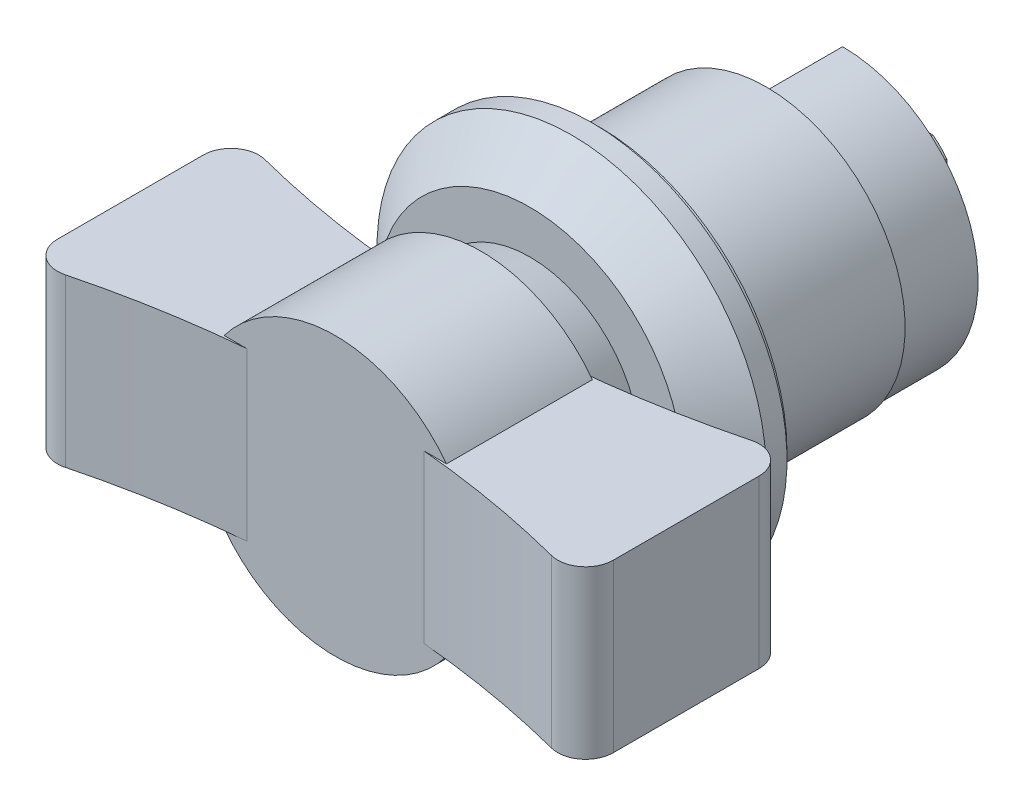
ISO-10303-21;
HEADER;
FILE_DESCRIPTION(('STEP AP214'),'2;1');
FILE_NAME('part.step','',(''),(''),'','','');
FILE_SCHEMA(('AUTOMOTIVE_DESIGN { 1 0 10303 214 1 1 1 1 }'));
ENDSEC;
DATA;
#1=APPLICATION_CONTEXT('core data for automotive mechanical design processes');
#2=APPLICATION_PROTOCOL_DEFINITION('international standard','automotive_design',2000,#1);
#3=PRODUCT_CONTEXT('',#1,'mechanical');
#4=PRODUCT('Part','Part','',(#3));
#5=PRODUCT_RELATED_PRODUCT_CATEGORY('part','',(#4));
#6=PRODUCT_DEFINITION_FORMATION('','',#4);
#7=PRODUCT_DEFINITION_CONTEXT('part definition',#1,'design');
#8=PRODUCT_DEFINITION('design','',#6,#7);
#9=PRODUCT_DEFINITION_SHAPE('','',#8);
#10=(LENGTH_UNIT() NAMED_UNIT(*) SI_UNIT(.MILLI.,.METRE.));
#11=(NAMED_UNIT(*) PLANE_ANGLE_UNIT() SI_UNIT($,.RADIAN.));
#12=(NAMED_UNIT(*) SI_UNIT($,.STERADIAN.) SOLID_ANGLE_UNIT());
#13=UNCERTAINTY_MEASURE_WITH_UNIT(LENGTH_MEASURE(1.E-05),#10,'distance_accuracy_value','');
#14=(GEOMETRIC_REPRESENTATION_CONTEXT(3) GLOBAL_UNCERTAINTY_ASSIGNED_CONTEXT((#13)) GLOBAL_UNIT_ASSIGNED_CONTEXT((#10,
#11,#12)) REPRESENTATION_CONTEXT('',''));
#15=CARTESIAN_POINT('',(0.,0.,0.));
#16=DIRECTION('',(0.,0.,1.));
#17=DIRECTION('',(1.,0.,0.));
#18=AXIS2_PLACEMENT_3D('',#15,#16,#17);
#19=CARTESIAN_POINT('',(0.,0.,5.));
#20=DIRECTION('',(0.,0.,1.));
#21=DIRECTION('',(0.,1.,0.));
#22=AXIS2_PLACEMENT_3D('',#19,#20,#21);
#23=CONICAL_SURFACE('',#22,7.9,0.174532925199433);
#24=CARTESIAN_POINT('',(0.,0.,5.));
#25=DIRECTION('',(0.,0.,1.));
#26=DIRECTION('',(0.,1.,0.));
#27=AXIS2_PLACEMENT_3D('',#24,#25,#26);
#28=CIRCLE('',#27,7.9);
#29=CARTESIAN_POINT('',(0.,7.9,5.));
#30=VERTEX_POINT('',#29);
#31=EDGE_CURVE('E221',#30,#30,#28,.T.);
#32=ORIENTED_EDGE('',*,*,#31,.T.);
#33=EDGE_LOOP('',(#32));
#34=FACE_BOUND('',#33,.T.);
#35=CARTESIAN_POINT('',(-6.3650101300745,5.65936835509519,8.5000182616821));
#36=CARTESIAN_POINT('',(-6.52348846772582,5.47732706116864,8.48554618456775));
#37=CARTESIAN_POINT('',(-6.67421622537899,5.28853534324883,8.47124040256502));
#38=CARTESIAN_POINT('',(-6.95922194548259,4.89888542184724,8.443354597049));
#39=CARTESIAN_POINT('',(-7.09350093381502,4.69802797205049,8.429774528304));
#40=CARTESIAN_POINT('',(-7.34459853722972,4.28579242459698,8.40373991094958));
#41=CARTESIAN_POINT('',(-7.46142848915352,4.07442127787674,8.3912846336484));
#42=CARTESIAN_POINT('',(-7.67694162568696,3.64254603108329,8.3678436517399));
#43=CARTESIAN_POINT('',(-7.77562494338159,3.42204199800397,8.35685793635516));
#44=CARTESIAN_POINT('',(-7.95420744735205,2.97336423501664,8.33666539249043));
#45=CARTESIAN_POINT('',(-8.03409846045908,2.74518721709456,8.32745933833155));
#46=CARTESIAN_POINT('',(-8.17449310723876,2.28286798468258,8.3110950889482));
#47=CARTESIAN_POINT('',(-8.23499634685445,2.04872564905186,8.30393693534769));
#48=CARTESIAN_POINT('',(-8.33617934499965,1.57621212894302,8.29187560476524));
#49=CARTESIAN_POINT('',(-8.37686501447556,1.33784222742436,8.28697175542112));
#50=CARTESIAN_POINT('',(-8.43815706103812,0.858499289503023,8.27955648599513));
#51=CARTESIAN_POINT('',(-8.45876356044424,0.617526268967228,8.27704505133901));
#52=CARTESIAN_POINT('',(-8.47975753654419,0.134609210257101,8.27448621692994));
#53=CARTESIAN_POINT('',(-8.48013842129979,-0.107335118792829,8.27443962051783));
#54=CARTESIAN_POINT('',(-8.46066189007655,-0.590395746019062,8.2768138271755));
#55=CARTESIAN_POINT('',(-8.44080445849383,-0.831512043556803,8.27923463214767));
#56=CARTESIAN_POINT('',(-8.38097280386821,-1.31133764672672,8.28647617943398));
#57=CARTESIAN_POINT('',(-8.34098721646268,-1.55004551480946,8.29129827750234));
#58=CARTESIAN_POINT('',(-8.24117327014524,-2.02321009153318,8.30320439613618));
#59=CARTESIAN_POINT('',(-8.18134557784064,-2.25766694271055,8.31028834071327));
#60=CARTESIAN_POINT('',(-8.04223492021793,-2.720762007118,8.32651816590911));
#61=CARTESIAN_POINT('',(-7.96294438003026,-2.94939791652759,8.33566484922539));
#62=CARTESIAN_POINT('',(-7.78546779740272,-3.39912743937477,8.35575637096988));
#63=CARTESIAN_POINT('',(-7.68728230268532,-3.62022127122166,8.36670115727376));
#64=CARTESIAN_POINT('',(-7.47285910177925,-4.05296235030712,8.39005736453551));
#65=CARTESIAN_POINT('',(-7.35664923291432,-4.26462352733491,8.40246651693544));
#66=CARTESIAN_POINT('',(-7.10690397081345,-4.67727413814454,8.42840647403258));
#67=CARTESIAN_POINT('',(-6.97337788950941,-4.8782692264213,8.4419366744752));
#68=CARTESIAN_POINT('',(-6.75815188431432,-5.17434161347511,8.46304239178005));
#69=CARTESIAN_POINT('',(-6.68243675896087,-5.27383960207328,8.47034986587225));
#70=CARTESIAN_POINT('',(-6.52683785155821,-5.46927356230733,8.48509655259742));
#71=CARTESIAN_POINT('',(-6.44696028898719,-5.56521450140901,8.49253555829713));
#72=CARTESIAN_POINT('',(-6.3650101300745,-5.65936835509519,8.50001826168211));
#73=B_SPLINE_CURVE_WITH_KNOTS('',3,(#35,#36,#37,#38,#39,#40,#41,#42,#43,#44,#45,#46,#47,#48,#49,
#50,#51,#52,#53,#54,#55,#56,#57,#58,#59,#60,#61,#62,#63,#64,#65,#66,#67,#68,#69,#70,#71,#72),
.UNSPECIFIED.,.F.,.F.,(4,2,2,2,2,2,2,2,2,2,2,2,2,2,2,2,2,2,4),(0.,0.725152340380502,
1.45025943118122,2.17489334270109,2.89952193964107,3.62446511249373,4.349423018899,
5.07416456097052,5.79890168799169,6.52387502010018,7.24884891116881,7.97423258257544,
8.6995918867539,9.42523394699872,10.1508549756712,10.8753662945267,11.5994896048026,
11.9751164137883,12.3501972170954),.UNSPECIFIED.);
#74=CARTESIAN_POINT('',(-6.36521013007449,5.65913856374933,8.5));
#75=VERTEX_POINT('',#74);
#76=CARTESIAN_POINT('',(-6.36521013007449,-5.65913856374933,8.5));
#77=VERTEX_POINT('',#76);
#78=EDGE_CURVE('E288',#75,#77,#73,.T.);
#79=ORIENTED_EDGE('',*,*,#78,.F.);
#80=CARTESIAN_POINT('',(0.,0.,8.5));
#81=DIRECTION('',(0.,0.,1.));
#82=DIRECTION('',(0.,1.,0.));
#83=AXIS2_PLACEMENT_3D('',#80,#81,#82);
#84=CIRCLE('',#83,8.51714443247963);
#85=CARTESIAN_POINT('',(6.36521013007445,5.65913856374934,8.5));
#86=VERTEX_POINT('',#85);
#87=EDGE_CURVE('E358',#86,#75,#84,.T.);
#88=ORIENTED_EDGE('',*,*,#87,.F.);
#89=CARTESIAN_POINT('',(6.36501013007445,-5.65936835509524,8.5000182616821));
#90=CARTESIAN_POINT('',(6.52348846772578,-5.4773270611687,8.48554618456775));
#91=CARTESIAN_POINT('',(6.67421622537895,-5.28853534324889,8.47124040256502));
#92=CARTESIAN_POINT('',(6.95922194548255,-4.89888542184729,8.443354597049));
#93=CARTESIAN_POINT('',(7.09350093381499,-4.69802797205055,8.42977452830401));
#94=CARTESIAN_POINT('',(7.34459853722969,-4.28579242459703,8.40373991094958));
#95=CARTESIAN_POINT('',(7.46142848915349,-4.07442127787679,8.3912846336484));
#96=CARTESIAN_POINT('',(7.67694162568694,-3.64254603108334,8.3678436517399));
#97=CARTESIAN_POINT('',(7.77562494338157,-3.42204199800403,8.35685793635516));
#98=CARTESIAN_POINT('',(7.95420744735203,-2.9733642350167,8.33666539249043));
#99=CARTESIAN_POINT('',(8.03409846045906,-2.74518721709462,8.32745933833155));
#100=CARTESIAN_POINT('',(8.17449310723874,-2.28286798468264,8.3110950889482));
#101=CARTESIAN_POINT('',(8.23499634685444,-2.04872564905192,8.30393693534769));
#102=CARTESIAN_POINT('',(8.33617934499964,-1.57621212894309,8.29187560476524));
#103=CARTESIAN_POINT('',(8.37686501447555,-1.33784222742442,8.28697175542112));
#104=CARTESIAN_POINT('',(8.43815706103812,-0.858499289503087,8.27955648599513));
#105=CARTESIAN_POINT('',(8.45876356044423,-0.617526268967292,8.27704505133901));
#106=CARTESIAN_POINT('',(8.47975753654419,-0.134609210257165,8.27448621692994));
#107=CARTESIAN_POINT('',(8.48013842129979,0.107335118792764,8.27443962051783));
#108=CARTESIAN_POINT('',(8.46066189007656,0.590395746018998,8.2768138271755));
#109=CARTESIAN_POINT('',(8.44080445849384,0.831512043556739,8.27923463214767));
#110=CARTESIAN_POINT('',(8.38097280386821,1.31133764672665,8.28647617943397));
#111=CARTESIAN_POINT('',(8.34098721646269,1.55004551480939,8.29129827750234));
#112=CARTESIAN_POINT('',(8.24117327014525,2.02321009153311,8.30320439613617));
#113=CARTESIAN_POINT('',(8.18134557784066,2.25766694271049,8.31028834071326));
#114=CARTESIAN_POINT('',(8.04223492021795,2.72076200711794,8.32651816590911));
#115=CARTESIAN_POINT('',(7.96294438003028,2.94939791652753,8.33566484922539));
#116=CARTESIAN_POINT('',(7.78546779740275,3.39912743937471,8.35575637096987));
#117=CARTESIAN_POINT('',(7.68728230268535,3.62022127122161,8.36670115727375));
#118=CARTESIAN_POINT('',(7.47285910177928,4.05296235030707,8.39005736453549));
#119=CARTESIAN_POINT('',(7.35664923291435,4.26462352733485,8.40246651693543));
#120=CARTESIAN_POINT('',(7.10690397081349,4.67727413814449,8.42840647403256));
#121=CARTESIAN_POINT('',(6.97337788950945,4.87826922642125,8.44193667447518));
#122=CARTESIAN_POINT('',(6.75815188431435,5.17434161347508,8.46304239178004));
#123=CARTESIAN_POINT('',(6.68243675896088,5.27383960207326,8.47034986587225));
#124=CARTESIAN_POINT('',(6.5268378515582,5.46927356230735,8.48509655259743));
#125=CARTESIAN_POINT('',(6.44696028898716,5.56521450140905,8.49253555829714));
#126=CARTESIAN_POINT('',(6.36501013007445,5.65936835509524,8.50001826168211));
#127=B_SPLINE_CURVE_WITH_KNOTS('',3,(#89,#90,#91,#92,#93,#94,#95,#96,#97,#98,#99,#100,#101,#102,
#103,#104,#105,#106,#107,#108,#109,#110,#111,#112,#113,#114,#115,#116,#117,#118,#119,#120,#121,
#122,#123,#124,#125,#126),.UNSPECIFIED.,.F.,.F.,(4,2,2,2,2,2,2,2,2,2,2,2,2,2,2,2,2,2,4),(0.,
0.725152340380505,1.45025943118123,2.1748933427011,2.89952193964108,3.62446511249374,
4.34942301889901,5.07416456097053,5.7989016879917,6.52387502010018,7.24884891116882,
7.97423258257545,8.69959188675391,9.42523394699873,10.1508549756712,10.8753662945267,
11.5994896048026,11.9751164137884,12.3501972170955),.UNSPECIFIED.);
#128=CARTESIAN_POINT('',(6.36521013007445,-5.65913856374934,8.5));
#129=VERTEX_POINT('',#128);
#130=EDGE_CURVE('E279',#129,#86,#127,.T.);
#131=ORIENTED_EDGE('',*,*,#130,.F.);
#132=EDGE_CURVE('E359',#77,#129,#84,.T.);
#133=ORIENTED_EDGE('',*,*,#132,.F.);
#134=EDGE_LOOP('',(#79,#88,#131,#133));
#135=FACE_BOUND('',#134,.T.);
#136=ADVANCED_FACE('F14',(#34,#135),#23,.T.);
#137=CARTESIAN_POINT('',(0.,0.,8.5));
#138=DIRECTION('',(0.,0.,1.));
#139=DIRECTION('',(0.,1.,0.));
#140=AXIS2_PLACEMENT_3D('',#137,#138,#139);
#141=PLANE('',#140);
#142=DIRECTION('',(1.,0.,0.));
#143=VECTOR('',#142,1.);
#144=CARTESIAN_POINT('',(0.,6.,8.5));
#145=LINE('',#144,#143);
#146=CARTESIAN_POINT('',(-8.,6.,8.5));
#147=VERTEX_POINT('',#146);
#148=CARTESIAN_POINT('',(-6.36521013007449,6.,8.5));
#149=VERTEX_POINT('',#148);
#150=EDGE_CURVE('E267',#147,#149,#145,.T.);
#151=ORIENTED_EDGE('',*,*,#150,.F.);
#152=CARTESIAN_POINT('',(0.,0.,8.5));
#153=DIRECTION('',(0.,0.,1.));
#154=DIRECTION('',(0.,1.,0.));
#155=AXIS2_PLACEMENT_3D('',#152,#153,#154);
#156=CIRCLE('',#155,10.);
#157=CARTESIAN_POINT('',(8.,6.,8.5));
#158=VERTEX_POINT('',#157);
#159=EDGE_CURVE('E360',#158,#147,#156,.T.);
#160=ORIENTED_EDGE('',*,*,#159,.F.);
#161=CARTESIAN_POINT('',(6.36521013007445,6.,8.5));
#162=VERTEX_POINT('',#161);
#163=EDGE_CURVE('E264',#162,#158,#145,.T.);
#164=ORIENTED_EDGE('',*,*,#163,.F.);
#165=DIRECTION('',(0.,1.,0.));
#166=VECTOR('',#165,1.);
#167=CARTESIAN_POINT('',(6.36521013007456,-6.,8.5));
#168=LINE('',#167,#166);
#169=EDGE_CURVE('E22',#86,#162,#168,.T.);
#170=ORIENTED_EDGE('',*,*,#169,.F.);
#171=ORIENTED_EDGE('',*,*,#87,.T.);
#172=DIRECTION('',(0.,1.,0.));
#173=VECTOR('',#172,1.);
#174=CARTESIAN_POINT('',(-6.36521013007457,-6.,8.5));
#175=LINE('',#174,#173);
#176=EDGE_CURVE('E9',#149,#75,#175,.F.);
#177=ORIENTED_EDGE('',*,*,#176,.F.);
#178=EDGE_LOOP('',(#151,#160,#164,#170,#171,#177));
#179=FACE_BOUND('',#178,.T.);
#180=ADVANCED_FACE('F327',(#179),#141,.F.);
#181=CARTESIAN_POINT('',(0.,0.,19.));
#182=DIRECTION('',(0.,0.,-1.));
#183=DIRECTION('',(0.,-1.,0.));
#184=AXIS2_PLACEMENT_3D('',#181,#182,#183);
#185=CYLINDRICAL_SURFACE('',#184,10.);
#186=DIRECTION('',(0.,0.,-1.));
#187=VECTOR('',#186,1.);
#188=CARTESIAN_POINT('',(-8.,6.,19.));
#189=LINE('',#188,#187);
#190=CARTESIAN_POINT('',(-8.,6.,19.));
#191=VERTEX_POINT('',#190);
#192=EDGE_CURVE('E266',#191,#147,#189,.T.);
#193=ORIENTED_EDGE('',*,*,#192,.F.);
#194=CARTESIAN_POINT('',(0.,0.,19.));
#195=DIRECTION('',(0.,0.,1.));
#196=DIRECTION('',(0.,1.,0.));
#197=AXIS2_PLACEMENT_3D('',#194,#195,#196);
#198=CIRCLE('',#197,10.);
#199=CARTESIAN_POINT('',(8.,6.,19.));
#200=VERTEX_POINT('',#199);
#201=EDGE_CURVE('E495',#200,#191,#198,.T.);
#202=ORIENTED_EDGE('',*,*,#201,.F.);
#203=DIRECTION('',(0.,0.,-1.));
#204=VECTOR('',#203,1.);
#205=CARTESIAN_POINT('',(8.,6.,19.));
#206=LINE('',#205,#204);
#207=EDGE_CURVE('E37',#158,#200,#206,.F.);
#208=ORIENTED_EDGE('',*,*,#207,.F.);
#209=ORIENTED_EDGE('',*,*,#159,.T.);
#210=EDGE_LOOP('',(#193,#202,#208,#209));
#211=FACE_BOUND('',#210,.T.);
#212=ADVANCED_FACE('F332',(#211),#185,.T.);
#213=CARTESIAN_POINT('',(0.,0.,-50.));
#214=DIRECTION('',(0.,0.,-1.));
#215=DIRECTION('',(0.,-1.,0.));
#216=AXIS2_PLACEMENT_3D('',#213,#214,#215);
#217=CYLINDRICAL_SURFACE('',#216,5.);
#218=CARTESIAN_POINT('',(0.,0.,-17.5));
#219=DIRECTION('',(0.,0.,-1.));
#220=DIRECTION('',(0.,-1.,0.));
#221=AXIS2_PLACEMENT_3D('',#218,#219,#220);
#222=CIRCLE('',#221,5.);
#223=CARTESIAN_POINT('',(-3.,-4.,-17.5));
#224=VERTEX_POINT('',#223);
#225=CARTESIAN_POINT('',(-4.,-3.,-17.5));
#226=VERTEX_POINT('',#225);
#227=EDGE_CURVE('E464',#224,#226,#222,.T.);
#228=ORIENTED_EDGE('',*,*,#227,.T.);
#229=DIRECTION('',(0.,0.,-1.));
#230=VECTOR('',#229,1.);
#231=CARTESIAN_POINT('',(-4.,-3.,-11.4172374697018));
#232=LINE('',#231,#230);
#233=CARTESIAN_POINT('',(-4.,-3.,-21.));
#234=VERTEX_POINT('',#233);
#235=EDGE_CURVE('E406',#226,#234,#232,.T.);
#236=ORIENTED_EDGE('',*,*,#235,.T.);
#237=CARTESIAN_POINT('',(0.,0.,-21.));
#238=DIRECTION('',(0.,0.,-1.));
#239=DIRECTION('',(0.,-1.,0.));
#240=AXIS2_PLACEMENT_3D('',#237,#238,#239);
#241=CIRCLE('',#240,5.);
#242=CARTESIAN_POINT('',(-3.,-4.,-21.));
#243=VERTEX_POINT('',#242);
#244=EDGE_CURVE('E466',#243,#234,#241,.T.);
#245=ORIENTED_EDGE('',*,*,#244,.F.);
#246=DIRECTION('',(0.,0.,-1.));
#247=VECTOR('',#246,1.);
#248=CARTESIAN_POINT('',(-3.,-4.,-11.4172374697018));
#249=LINE('',#248,#247);
#250=EDGE_CURVE('E430',#224,#243,#249,.T.);
#251=ORIENTED_EDGE('',*,*,#250,.F.);
#252=EDGE_LOOP('',(#228,#236,#245,#251));
#253=FACE_BOUND('',#252,.T.);
#254=ADVANCED_FACE('F339',(#253),#217,.T.);
#255=DIRECTION('',(0.,0.,-1.));
#256=VECTOR('',#255,1.);
#257=CARTESIAN_POINT('',(4.,-3.,-11.4172374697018));
#258=LINE('',#257,#256);
#259=CARTESIAN_POINT('',(4.,-3.,-17.5));
#260=VERTEX_POINT('',#259);
#261=CARTESIAN_POINT('',(4.,-3.,-21.));
#262=VERTEX_POINT('',#261);
#263=EDGE_CURVE('E411',#260,#262,#258,.T.);
#264=ORIENTED_EDGE('',*,*,#263,.F.);
#265=CARTESIAN_POINT('',(3.,-4.,-17.5));
#266=VERTEX_POINT('',#265);
#267=EDGE_CURVE('E471',#260,#266,#222,.T.);
#268=ORIENTED_EDGE('',*,*,#267,.T.);
#269=DIRECTION('',(0.,0.,-1.));
#270=VECTOR('',#269,1.);
#271=CARTESIAN_POINT('',(3.,-4.,-11.4172374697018));
#272=LINE('',#271,#270);
#273=CARTESIAN_POINT('',(3.,-4.,-21.));
#274=VERTEX_POINT('',#273);
#275=EDGE_CURVE('E427',#266,#274,#272,.T.);
#276=ORIENTED_EDGE('',*,*,#275,.T.);
#277=EDGE_CURVE('E465',#262,#274,#241,.T.);
#278=ORIENTED_EDGE('',*,*,#277,.F.);
#279=EDGE_LOOP('',(#264,#268,#276,#278));
#280=FACE_BOUND('',#279,.T.);
#281=ADVANCED_FACE('F681',(#280),#217,.T.);
#282=DIRECTION('',(0.,0.,-1.));
#283=VECTOR('',#282,1.);
#284=CARTESIAN_POINT('',(4.,3.,-11.4172374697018));
#285=LINE('',#284,#283);
#286=CARTESIAN_POINT('',(4.,3.,-17.5));
#287=VERTEX_POINT('',#286);
#288=CARTESIAN_POINT('',(4.,3.,-21.));
#289=VERTEX_POINT('',#288);
#290=EDGE_CURVE('E416',#287,#289,#285,.T.);
#291=ORIENTED_EDGE('',*,*,#290,.T.);
#292=CARTESIAN_POINT('',(3.,4.,-21.));
#293=VERTEX_POINT('',#292);
#294=EDGE_CURVE('E461',#293,#289,#241,.T.);
#295=ORIENTED_EDGE('',*,*,#294,.F.);
#296=DIRECTION('',(0.,0.,-1.));
#297=VECTOR('',#296,1.);
#298=CARTESIAN_POINT('',(3.,4.,-11.4172374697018));
#299=LINE('',#298,#297);
#300=CARTESIAN_POINT('',(3.,4.,-17.5));
#301=VERTEX_POINT('',#300);
#302=EDGE_CURVE('E432',#301,#293,#299,.T.);
#303=ORIENTED_EDGE('',*,*,#302,.F.);
#304=EDGE_CURVE('E467',#301,#287,#222,.T.);
#305=ORIENTED_EDGE('',*,*,#304,.T.);
#306=EDGE_LOOP('',(#291,#295,#303,#305));
#307=FACE_BOUND('',#306,.T.);
#308=ADVANCED_FACE('F690',(#307),#217,.T.);
#309=CARTESIAN_POINT('',(-5.,0.,-21.));
#310=DIRECTION('',(0.,0.,1.));
#311=DIRECTION('',(0.,1.,0.));
#312=AXIS2_PLACEMENT_3D('',#309,#310,#311);
#313=PLANE('',#312);
#314=CARTESIAN_POINT('',(0.,0.,-21.));
#315=DIRECTION('',(0.,0.,-1.));
#316=DIRECTION('',(0.,-1.,0.));
#317=AXIS2_PLACEMENT_3D('',#314,#315,#316);
#318=CIRCLE('',#317,3.);
#319=CARTESIAN_POINT('',(0.,-3.,-21.));
#320=VERTEX_POINT('',#319);
#321=EDGE_CURVE('E365',#320,#320,#318,.T.);
#322=ORIENTED_EDGE('',*,*,#321,.F.);
#323=EDGE_LOOP('',(#322));
#324=FACE_BOUND('',#323,.T.);
#325=ORIENTED_EDGE('',*,*,#244,.T.);
#326=DIRECTION('',(0.,-1.,0.));
#327=VECTOR('',#326,1.);
#328=CARTESIAN_POINT('',(-4.,3.,-21.));
#329=LINE('',#328,#327);
#330=CARTESIAN_POINT('',(-4.,3.,-21.));
#331=VERTEX_POINT('',#330);
#332=EDGE_CURVE('E402',#331,#234,#329,.T.);
#333=ORIENTED_EDGE('',*,*,#332,.F.);
#334=CARTESIAN_POINT('',(-3.,4.,-21.));
#335=VERTEX_POINT('',#334);
#336=EDGE_CURVE('E460',#331,#335,#241,.T.);
#337=ORIENTED_EDGE('',*,*,#336,.T.);
#338=DIRECTION('',(1.,0.,0.));
#339=VECTOR('',#338,1.);
#340=CARTESIAN_POINT('',(-3.,4.,-21.));
#341=LINE('',#340,#339);
#342=EDGE_CURVE('E433',#335,#293,#341,.T.);
#343=ORIENTED_EDGE('',*,*,#342,.T.);
#344=ORIENTED_EDGE('',*,*,#294,.T.);
#345=DIRECTION('',(0.,-1.,0.));
#346=VECTOR('',#345,1.);
#347=CARTESIAN_POINT('',(4.,3.,-21.));
#348=LINE('',#347,#346);
#349=EDGE_CURVE('E412',#289,#262,#348,.T.);
#350=ORIENTED_EDGE('',*,*,#349,.T.);
#351=ORIENTED_EDGE('',*,*,#277,.T.);
#352=DIRECTION('',(1.,0.,0.));
#353=VECTOR('',#352,1.);
#354=CARTESIAN_POINT('',(-3.,-4.,-21.));
#355=LINE('',#354,#353);
#356=EDGE_CURVE('E418',#243,#274,#355,.T.);
#357=ORIENTED_EDGE('',*,*,#356,.F.);
#358=EDGE_LOOP('',(#325,#333,#337,#343,#344,#350,#351,#357));
#359=FACE_BOUND('',#358,.T.);
#360=ADVANCED_FACE('F698',(#324,#359),#313,.F.);
#361=ORIENTED_EDGE('',*,*,#336,.F.);
#362=DIRECTION('',(0.,0.,-1.));
#363=VECTOR('',#362,1.);
#364=CARTESIAN_POINT('',(-4.,3.,-11.4172374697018));
#365=LINE('',#364,#363);
#366=CARTESIAN_POINT('',(-4.,3.,-17.5));
#367=VERTEX_POINT('',#366);
#368=EDGE_CURVE('E409',#367,#331,#365,.T.);
#369=ORIENTED_EDGE('',*,*,#368,.F.);
#370=CARTESIAN_POINT('',(0.,0.,-17.5));
#371=DIRECTION('',(0.,0.,-1.));
#372=DIRECTION('',(0.,-1.,0.));
#373=AXIS2_PLACEMENT_3D('',#370,#371,#372);
#374=CIRCLE('',#373,5.);
#375=CARTESIAN_POINT('',(-5.,0.,-17.5));
#376=VERTEX_POINT('',#375);
#377=EDGE_CURVE('E382',#376,#367,#374,.T.);
#378=ORIENTED_EDGE('',*,*,#377,.F.);
#379=DIRECTION('',(0.,0.,-1.));
#380=VECTOR('',#379,1.);
#381=CARTESIAN_POINT('',(-5.,0.,1.78858223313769));
#382=LINE('',#381,#380);
#383=CARTESIAN_POINT('',(-5.,0.,-12.));
#384=VERTEX_POINT('',#383);
#385=EDGE_CURVE('E397',#384,#376,#382,.T.);
#386=ORIENTED_EDGE('',*,*,#385,.F.);
#387=CARTESIAN_POINT('',(0.,0.,-12.));
#388=DIRECTION('',(0.,0.,1.));
#389=DIRECTION('',(0.,1.,0.));
#390=AXIS2_PLACEMENT_3D('',#387,#388,#389);
#391=CIRCLE('',#390,5.);
#392=CARTESIAN_POINT('',(0.,5.,-12.));
#393=VERTEX_POINT('',#392);
#394=EDGE_CURVE('E389',#384,#393,#391,.F.);
#395=ORIENTED_EDGE('',*,*,#394,.T.);
#396=DIRECTION('',(0.,0.,-1.));
#397=VECTOR('',#396,1.);
#398=CARTESIAN_POINT('',(0.,5.,1.78858223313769));
#399=LINE('',#398,#397);
#400=CARTESIAN_POINT('',(0.,5.,-17.5));
#401=VERTEX_POINT('',#400);
#402=EDGE_CURVE('E392',#393,#401,#399,.T.);
#403=ORIENTED_EDGE('',*,*,#402,.T.);
#404=CARTESIAN_POINT('',(-3.,4.,-17.5));
#405=VERTEX_POINT('',#404);
#406=EDGE_CURVE('E384',#405,#401,#374,.T.);
#407=ORIENTED_EDGE('',*,*,#406,.F.);
#408=DIRECTION('',(0.,0.,-1.));
#409=VECTOR('',#408,1.);
#410=CARTESIAN_POINT('',(-3.,4.,-11.4172374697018));
#411=LINE('',#410,#409);
#412=EDGE_CURVE('E437',#405,#335,#411,.T.);
#413=ORIENTED_EDGE('',*,*,#412,.T.);
#414=EDGE_LOOP('',(#361,#369,#378,#386,#395,#403,#407,#413));
#415=FACE_BOUND('',#414,.T.);
#416=ADVANCED_FACE('F684',(#415),#217,.T.);
#417=CARTESIAN_POINT('',(0.,0.,-50.));
#418=DIRECTION('',(0.,0.,-1.));
#419=DIRECTION('',(0.,-1.,0.));
#420=AXIS2_PLACEMENT_3D('',#417,#418,#419);
#421=CYLINDRICAL_SURFACE('',#420,10.);
#422=CARTESIAN_POINT('',(0.,0.,-12.));
#423=DIRECTION('',(0.,0.,-1.));
#424=DIRECTION('',(0.,-1.,0.));
#425=AXIS2_PLACEMENT_3D('',#422,#423,#424);
#426=CIRCLE('',#425,10.);
#427=CARTESIAN_POINT('',(0.,-10.,-12.));
#428=VERTEX_POINT('',#427);
#429=EDGE_CURVE('E477',#428,#428,#426,.T.);
#430=ORIENTED_EDGE('',*,*,#429,.F.);
#431=EDGE_LOOP('',(#430));
#432=FACE_BOUND('',#431,.T.);
#433=CARTESIAN_POINT('',(0.,0.,0.));
#434=DIRECTION('',(0.,0.,-1.));
#435=DIRECTION('',(0.,-1.,0.));
#436=AXIS2_PLACEMENT_3D('',#433,#434,#435);
#437=CIRCLE('',#436,10.);
#438=CARTESIAN_POINT('',(0.,-10.,0.));
#439=VERTEX_POINT('',#438);
#440=EDGE_CURVE('E439',#439,#439,#437,.T.);
#441=ORIENTED_EDGE('',*,*,#440,.T.);
#442=EDGE_LOOP('',(#441));
#443=FACE_BOUND('',#442,.T.);
#444=ADVANCED_FACE('F16',(#432,#443),#421,.T.);
#445=CARTESIAN_POINT('',(-10.,0.,-12.));
#446=DIRECTION('',(0.,0.,1.));
#447=DIRECTION('',(0.,1.,0.));
#448=AXIS2_PLACEMENT_3D('',#445,#446,#447);
#449=PLANE('',#448);
#450=CARTESIAN_POINT('',(0.,0.,-12.));
#451=DIRECTION('',(0.,0.,-1.));
#452=DIRECTION('',(0.,-1.,0.));
#453=AXIS2_PLACEMENT_3D('',#450,#451,#452);
#454=CIRCLE('',#453,9.75);
#455=CARTESIAN_POINT('',(0.,9.75,-12.));
#456=VERTEX_POINT('',#455);
#457=CARTESIAN_POINT('',(-9.75,0.,-12.));
#458=VERTEX_POINT('',#457);
#459=EDGE_CURVE('E474',#456,#458,#454,.T.);
#460=ORIENTED_EDGE('',*,*,#459,.F.);
#461=DIRECTION('',(0.,-1.,0.));
#462=VECTOR('',#461,1.);
#463=CARTESIAN_POINT('',(0.,9.75,-12.));
#464=LINE('',#463,#462);
#465=EDGE_CURVE('E388',#456,#393,#464,.T.);
#466=ORIENTED_EDGE('',*,*,#465,.T.);
#467=ORIENTED_EDGE('',*,*,#394,.F.);
#468=DIRECTION('',(1.,0.,0.));
#469=VECTOR('',#468,1.);
#470=CARTESIAN_POINT('',(-9.75,0.,-12.));
#471=LINE('',#470,#469);
#472=EDGE_CURVE('E376',#458,#384,#471,.T.);
#473=ORIENTED_EDGE('',*,*,#472,.F.);
#474=EDGE_LOOP('',(#460,#466,#467,#473));
#475=FACE_BOUND('',#474,.T.);
#476=ORIENTED_EDGE('',*,*,#429,.T.);
#477=EDGE_LOOP('',(#476));
#478=FACE_BOUND('',#477,.T.);
#479=ADVANCED_FACE('F721',(#475,#478),#449,.F.);
#480=CARTESIAN_POINT('',(0.,0.,-50.));
#481=DIRECTION('',(0.,0.,-1.));
#482=DIRECTION('',(0.,-1.,0.));
#483=AXIS2_PLACEMENT_3D('',#480,#481,#482);
#484=CYLINDRICAL_SURFACE('',#483,9.75);
#485=CARTESIAN_POINT('',(0.,0.,-17.5));
#486=DIRECTION('',(0.,0.,-1.));
#487=DIRECTION('',(0.,-1.,0.));
#488=AXIS2_PLACEMENT_3D('',#485,#486,#487);
#489=CIRCLE('',#488,9.75);
#490=CARTESIAN_POINT('',(0.,9.75,-17.5));
#491=VERTEX_POINT('',#490);
#492=CARTESIAN_POINT('',(-9.75,0.,-17.5));
#493=VERTEX_POINT('',#492);
#494=EDGE_CURVE('E470',#491,#493,#489,.T.);
#495=ORIENTED_EDGE('',*,*,#494,.F.);
#496=DIRECTION('',(0.,0.,-1.));
#497=VECTOR('',#496,1.);
#498=CARTESIAN_POINT('',(0.,9.75,1.78858223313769));
#499=LINE('',#498,#497);
#500=EDGE_CURVE('E380',#456,#491,#499,.T.);
#501=ORIENTED_EDGE('',*,*,#500,.F.);
#502=ORIENTED_EDGE('',*,*,#459,.T.);
#503=DIRECTION('',(0.,0.,-1.));
#504=VECTOR('',#503,1.);
#505=CARTESIAN_POINT('',(-9.75,0.,1.78858223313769));
#506=LINE('',#505,#504);
#507=EDGE_CURVE('E381',#458,#493,#506,.T.);
#508=ORIENTED_EDGE('',*,*,#507,.T.);
#509=EDGE_LOOP('',(#495,#501,#502,#508));
#510=FACE_BOUND('',#509,.T.);
#511=ADVANCED_FACE('F729',(#510),#484,.T.);
#512=CARTESIAN_POINT('',(-9.75,0.,-17.5));
#513=DIRECTION('',(0.,0.,1.));
#514=DIRECTION('',(0.,1.,0.));
#515=AXIS2_PLACEMENT_3D('',#512,#513,#514);
#516=PLANE('',#515);
#517=ORIENTED_EDGE('',*,*,#406,.T.);
#518=DIRECTION('',(0.,-1.,0.));
#519=VECTOR('',#518,1.);
#520=CARTESIAN_POINT('',(0.,9.75,-17.5));
#521=LINE('',#520,#519);
#522=EDGE_CURVE('E385',#491,#401,#521,.T.);
#523=ORIENTED_EDGE('',*,*,#522,.F.);
#524=ORIENTED_EDGE('',*,*,#494,.T.);
#525=DIRECTION('',(1.,0.,0.));
#526=VECTOR('',#525,1.);
#527=CARTESIAN_POINT('',(-9.75,0.,-17.5));
#528=LINE('',#527,#526);
#529=EDGE_CURVE('E377',#493,#376,#528,.T.);
#530=ORIENTED_EDGE('',*,*,#529,.T.);
#531=ORIENTED_EDGE('',*,*,#377,.T.);
#532=DIRECTION('',(0.,-1.,0.));
#533=VECTOR('',#532,1.);
#534=CARTESIAN_POINT('',(-4.,3.,-17.5));
#535=LINE('',#534,#533);
#536=EDGE_CURVE('E404',#367,#226,#535,.T.);
#537=ORIENTED_EDGE('',*,*,#536,.T.);
#538=ORIENTED_EDGE('',*,*,#227,.F.);
#539=DIRECTION('',(1.,0.,0.));
#540=VECTOR('',#539,1.);
#541=CARTESIAN_POINT('',(-3.,-4.,-17.5));
#542=LINE('',#541,#540);
#543=EDGE_CURVE('E424',#224,#266,#542,.T.);
#544=ORIENTED_EDGE('',*,*,#543,.T.);
#545=ORIENTED_EDGE('',*,*,#267,.F.);
#546=DIRECTION('',(0.,-1.,0.));
#547=VECTOR('',#546,1.);
#548=CARTESIAN_POINT('',(4.,3.,-17.5));
#549=LINE('',#548,#547);
#550=EDGE_CURVE('E415',#287,#260,#549,.T.);
#551=ORIENTED_EDGE('',*,*,#550,.F.);
#552=ORIENTED_EDGE('',*,*,#304,.F.);
#553=DIRECTION('',(1.,0.,0.));
#554=VECTOR('',#553,1.);
#555=CARTESIAN_POINT('',(-3.,4.,-17.5));
#556=LINE('',#555,#554);
#557=EDGE_CURVE('E436',#405,#301,#556,.T.);
#558=ORIENTED_EDGE('',*,*,#557,.F.);
#559=EDGE_LOOP('',(#517,#523,#524,#530,#531,#537,#538,#544,#545,#551,#552,#558));
#560=FACE_BOUND('',#559,.T.);
#561=ADVANCED_FACE('F737',(#560),#516,.F.);
#562=CARTESIAN_POINT('',(-11.,0.,5.));
#563=DIRECTION('',(0.,0.,1.));
#564=DIRECTION('',(0.,1.,0.));
#565=AXIS2_PLACEMENT_3D('',#562,#563,#564);
#566=PLANE('',#565);
#567=ORIENTED_EDGE('',*,*,#31,.F.);
#568=EDGE_LOOP('',(#567));
#569=FACE_BOUND('',#568,.T.);
#570=CARTESIAN_POINT('',(0.,0.,5.));
#571=DIRECTION('',(0.,0.,-1.));
#572=DIRECTION('',(0.,-1.,0.));
#573=AXIS2_PLACEMENT_3D('',#570,#571,#572);
#574=CIRCLE('',#573,11.);
#575=CARTESIAN_POINT('',(0.,-11.,5.));
#576=VERTEX_POINT('',#575);
#577=EDGE_CURVE('E457',#576,#576,#574,.T.);
#578=ORIENTED_EDGE('',*,*,#577,.F.);
#579=EDGE_LOOP('',(#578));
#580=FACE_BOUND('',#579,.T.);
#581=ADVANCED_FACE('F746',(#569,#580),#566,.T.);
#582=CARTESIAN_POINT('',(0.,0.,5.));
#583=DIRECTION('',(0.,0.,-1.));
#584=DIRECTION('',(0.,-1.,0.));
#585=AXIS2_PLACEMENT_3D('',#582,#583,#584);
#586=CONICAL_SURFACE('',#585,11.,0.785398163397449);
#587=CARTESIAN_POINT('',(0.,0.,2.));
#588=DIRECTION('',(0.,0.,-1.));
#589=DIRECTION('',(0.,-1.,0.));
#590=AXIS2_PLACEMENT_3D('',#587,#588,#589);
#591=CIRCLE('',#590,14.);
#592=CARTESIAN_POINT('',(0.,-14.,2.));
#593=VERTEX_POINT('',#592);
#594=EDGE_CURVE('E454',#593,#593,#591,.T.);
#595=ORIENTED_EDGE('',*,*,#594,.F.);
#596=EDGE_LOOP('',(#595));
#597=FACE_BOUND('',#596,.T.);
#598=ORIENTED_EDGE('',*,*,#577,.T.);
#599=EDGE_LOOP('',(#598));
#600=FACE_BOUND('',#599,.T.);
#601=ADVANCED_FACE('F755',(#597,#600),#586,.T.);
#602=CARTESIAN_POINT('',(0.,0.,-50.));
#603=DIRECTION('',(0.,0.,-1.));
#604=DIRECTION('',(0.,-1.,0.));
#605=AXIS2_PLACEMENT_3D('',#602,#603,#604);
#606=CYLINDRICAL_SURFACE('',#605,14.);
#607=ORIENTED_EDGE('',*,*,#594,.T.);
#608=EDGE_LOOP('',(#607));
#609=FACE_BOUND('',#608,.T.);
#610=CARTESIAN_POINT('',(0.,0.,0.500000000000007));
#611=DIRECTION('',(0.,0.,-1.));
#612=DIRECTION('',(0.,-1.,0.));
#613=AXIS2_PLACEMENT_3D('',#610,#611,#612);
#614=CIRCLE('',#613,14.);
#615=CARTESIAN_POINT('',(0.,-14.,0.500000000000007));
#616=VERTEX_POINT('',#615);
#617=EDGE_CURVE('E451',#616,#616,#614,.T.);
#618=ORIENTED_EDGE('',*,*,#617,.F.);
#619=EDGE_LOOP('',(#618));
#620=FACE_BOUND('',#619,.T.);
#621=ADVANCED_FACE('F764',(#609,#620),#606,.T.);
#622=CARTESIAN_POINT('',(-14.,0.,0.50000000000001));
#623=DIRECTION('',(0.,0.,1.));
#624=DIRECTION('',(0.,1.,0.));
#625=AXIS2_PLACEMENT_3D('',#622,#623,#624);
#626=PLANE('',#625);
#627=CARTESIAN_POINT('',(0.,0.,0.500000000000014));
#628=DIRECTION('',(0.,0.,-1.));
#629=DIRECTION('',(0.,-1.,0.));
#630=AXIS2_PLACEMENT_3D('',#627,#628,#629);
#631=CIRCLE('',#630,13.5);
#632=CARTESIAN_POINT('',(0.,-13.5,0.500000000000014));
#633=VERTEX_POINT('',#632);
#634=EDGE_CURVE('E448',#633,#633,#631,.T.);
#635=ORIENTED_EDGE('',*,*,#634,.F.);
#636=EDGE_LOOP('',(#635));
#637=FACE_BOUND('',#636,.T.);
#638=ORIENTED_EDGE('',*,*,#617,.T.);
#639=EDGE_LOOP('',(#638));
#640=FACE_BOUND('',#639,.T.);
#641=ADVANCED_FACE('F773',(#637,#640),#626,.F.);
#642=CARTESIAN_POINT('',(0.,0.,-50.));
#643=DIRECTION('',(0.,0.,-1.));
#644=DIRECTION('',(0.,-1.,0.));
#645=AXIS2_PLACEMENT_3D('',#642,#643,#644);
#646=CYLINDRICAL_SURFACE('',#645,13.5);
#647=ORIENTED_EDGE('',*,*,#634,.T.);
#648=EDGE_LOOP('',(#647));
#649=FACE_BOUND('',#648,.T.);
#650=CARTESIAN_POINT('',(0.,0.,0.));
#651=DIRECTION('',(0.,0.,-1.));
#652=DIRECTION('',(0.,-1.,0.));
#653=AXIS2_PLACEMENT_3D('',#650,#651,#652);
#654=CIRCLE('',#653,13.5);
#655=CARTESIAN_POINT('',(0.,-13.5,0.));
#656=VERTEX_POINT('',#655);
#657=EDGE_CURVE('E445',#656,#656,#654,.T.);
#658=ORIENTED_EDGE('',*,*,#657,.F.);
#659=EDGE_LOOP('',(#658));
#660=FACE_BOUND('',#659,.T.);
#661=ADVANCED_FACE('F782',(#649,#660),#646,.T.);
#662=CARTESIAN_POINT('',(-13.5,0.,0.));
#663=DIRECTION('',(0.,0.,1.));
#664=DIRECTION('',(0.,1.,0.));
#665=AXIS2_PLACEMENT_3D('',#662,#663,#664);
#666=PLANE('',#665);
#667=ORIENTED_EDGE('',*,*,#440,.F.);
#668=EDGE_LOOP('',(#667));
#669=FACE_BOUND('',#668,.T.);
#670=ORIENTED_EDGE('',*,*,#657,.T.);
#671=EDGE_LOOP('',(#670));
#672=FACE_BOUND('',#671,.T.);
#673=ADVANCED_FACE('F791',(#669,#672),#666,.F.);
#674=CARTESIAN_POINT('',(-3.,4.,-11.4172374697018));
#675=DIRECTION('',(0.,1.,0.));
#676=DIRECTION('',(0.,0.,-1.));
#677=AXIS2_PLACEMENT_3D('',#674,#675,#676);
#678=PLANE('',#677);
#679=ORIENTED_EDGE('',*,*,#557,.T.);
#680=ORIENTED_EDGE('',*,*,#302,.T.);
#681=ORIENTED_EDGE('',*,*,#342,.F.);
#682=ORIENTED_EDGE('',*,*,#412,.F.);
#683=EDGE_LOOP('',(#679,#680,#681,#682));
#684=FACE_BOUND('',#683,.T.);
#685=ADVANCED_FACE('F800',(#684),#678,.T.);
#686=CARTESIAN_POINT('',(-3.,-4.,-11.4172374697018));
#687=DIRECTION('',(0.,1.,0.));
#688=DIRECTION('',(0.,0.,-1.));
#689=AXIS2_PLACEMENT_3D('',#686,#687,#688);
#690=PLANE('',#689);
#691=ORIENTED_EDGE('',*,*,#250,.T.);
#692=ORIENTED_EDGE('',*,*,#356,.T.);
#693=ORIENTED_EDGE('',*,*,#275,.F.);
#694=ORIENTED_EDGE('',*,*,#543,.F.);
#695=EDGE_LOOP('',(#691,#692,#693,#694));
#696=FACE_BOUND('',#695,.T.);
#697=ADVANCED_FACE('F809',(#696),#690,.F.);
#698=CARTESIAN_POINT('',(4.,3.,-11.4172374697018));
#699=DIRECTION('',(1.,0.,0.));
#700=DIRECTION('',(0.,1.,0.));
#701=AXIS2_PLACEMENT_3D('',#698,#699,#700);
#702=PLANE('',#701);
#703=ORIENTED_EDGE('',*,*,#550,.T.);
#704=ORIENTED_EDGE('',*,*,#263,.T.);
#705=ORIENTED_EDGE('',*,*,#349,.F.);
#706=ORIENTED_EDGE('',*,*,#290,.F.);
#707=EDGE_LOOP('',(#703,#704,#705,#706));
#708=FACE_BOUND('',#707,.T.);
#709=ADVANCED_FACE('F818',(#708),#702,.T.);
#710=CARTESIAN_POINT('',(-4.,3.,-11.4172374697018));
#711=DIRECTION('',(1.,0.,0.));
#712=DIRECTION('',(0.,1.,0.));
#713=AXIS2_PLACEMENT_3D('',#710,#711,#712);
#714=PLANE('',#713);
#715=ORIENTED_EDGE('',*,*,#368,.T.);
#716=ORIENTED_EDGE('',*,*,#332,.T.);
#717=ORIENTED_EDGE('',*,*,#235,.F.);
#718=ORIENTED_EDGE('',*,*,#536,.F.);
#719=EDGE_LOOP('',(#715,#716,#717,#718));
#720=FACE_BOUND('',#719,.T.);
#721=ADVANCED_FACE('F827',(#720),#714,.F.);
#722=CARTESIAN_POINT('',(0.,9.75,1.78858223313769));
#723=DIRECTION('',(1.,0.,0.));
#724=DIRECTION('',(0.,1.,0.));
#725=AXIS2_PLACEMENT_3D('',#722,#723,#724);
#726=PLANE('',#725);
#727=ORIENTED_EDGE('',*,*,#500,.T.);
#728=ORIENTED_EDGE('',*,*,#522,.T.);
#729=ORIENTED_EDGE('',*,*,#402,.F.);
#730=ORIENTED_EDGE('',*,*,#465,.F.);
#731=EDGE_LOOP('',(#727,#728,#729,#730));
#732=FACE_BOUND('',#731,.T.);
#733=ADVANCED_FACE('F836',(#732),#726,.F.);
#734=CARTESIAN_POINT('',(-9.75,0.,1.78858223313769));
#735=DIRECTION('',(0.,1.,0.));
#736=DIRECTION('',(0.,0.,-1.));
#737=AXIS2_PLACEMENT_3D('',#734,#735,#736);
#738=PLANE('',#737);
#739=ORIENTED_EDGE('',*,*,#472,.T.);
#740=ORIENTED_EDGE('',*,*,#385,.T.);
#741=ORIENTED_EDGE('',*,*,#529,.F.);
#742=ORIENTED_EDGE('',*,*,#507,.F.);
#743=EDGE_LOOP('',(#739,#740,#741,#742));
#744=FACE_BOUND('',#743,.T.);
#745=ADVANCED_FACE('F845',(#744),#738,.T.);
#746=CARTESIAN_POINT('',(0.,0.,-11.));
#747=DIRECTION('',(0.,0.,-1.));
#748=DIRECTION('',(0.,-1.,0.));
#749=AXIS2_PLACEMENT_3D('',#746,#747,#748);
#750=CYLINDRICAL_SURFACE('',#749,3.);
#751=CARTESIAN_POINT('',(0.,0.,-11.));
#752=DIRECTION('',(0.,0.,-1.));
#753=DIRECTION('',(0.,-1.,0.));
#754=AXIS2_PLACEMENT_3D('',#751,#752,#753);
#755=CIRCLE('',#754,3.);
#756=CARTESIAN_POINT('',(0.,-3.,-11.));
#757=VERTEX_POINT('',#756);
#758=EDGE_CURVE('E368',#757,#757,#755,.T.);
#759=ORIENTED_EDGE('',*,*,#758,.F.);
#760=EDGE_LOOP('',(#759));
#761=FACE_BOUND('',#760,.T.);
#762=ORIENTED_EDGE('',*,*,#321,.T.);
#763=EDGE_LOOP('',(#762));
#764=FACE_BOUND('',#763,.T.);
#765=ADVANCED_FACE('F328',(#761,#764),#750,.F.);
#766=CARTESIAN_POINT('',(0.,0.,-11.));
#767=DIRECTION('',(0.,0.,-1.));
#768=DIRECTION('',(0.,-1.,0.));
#769=AXIS2_PLACEMENT_3D('',#766,#767,#768);
#770=PLANE('',#769);
#771=ORIENTED_EDGE('',*,*,#758,.T.);
#772=EDGE_LOOP('',(#771));
#773=FACE_BOUND('',#772,.T.);
#774=ADVANCED_FACE('F325',(#773),#770,.T.);
#775=CARTESIAN_POINT('',(-8.,-6.,8.5));
#776=VERTEX_POINT('',#775);
#777=CARTESIAN_POINT('',(8.,-6.,8.5));
#778=VERTEX_POINT('',#777);
#779=EDGE_CURVE('E500',#776,#778,#156,.T.);
#780=ORIENTED_EDGE('',*,*,#779,.F.);
#781=DIRECTION('',(1.,0.,0.));
#782=VECTOR('',#781,1.);
#783=CARTESIAN_POINT('',(0.,-6.,8.5));
#784=LINE('',#783,#782);
#785=CARTESIAN_POINT('',(-6.36521013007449,-6.,8.5));
#786=VERTEX_POINT('',#785);
#787=EDGE_CURVE('E276',#776,#786,#784,.T.);
#788=ORIENTED_EDGE('',*,*,#787,.T.);
#789=DIRECTION('',(0.,1.,0.));
#790=VECTOR('',#789,1.);
#791=CARTESIAN_POINT('',(-6.36521013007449,-6.,8.5));
#792=LINE('',#791,#790);
#793=EDGE_CURVE('E252',#786,#77,#792,.T.);
#794=ORIENTED_EDGE('',*,*,#793,.T.);
#795=ORIENTED_EDGE('',*,*,#132,.T.);
#796=DIRECTION('',(0.,1.,0.));
#797=VECTOR('',#796,1.);
#798=CARTESIAN_POINT('',(6.36521013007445,-6.,8.5));
#799=LINE('',#798,#797);
#800=CARTESIAN_POINT('',(6.36521013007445,-6.,8.5));
#801=VERTEX_POINT('',#800);
#802=EDGE_CURVE('E249',#801,#129,#799,.T.);
#803=ORIENTED_EDGE('',*,*,#802,.F.);
#804=EDGE_CURVE('E272',#801,#778,#784,.T.);
#805=ORIENTED_EDGE('',*,*,#804,.T.);
#806=EDGE_LOOP('',(#780,#788,#794,#795,#803,#805));
#807=FACE_BOUND('',#806,.T.);
#808=ADVANCED_FACE('F321',(#807),#141,.F.);
#809=CARTESIAN_POINT('',(-8.,-6.,19.));
#810=VERTEX_POINT('',#809);
#811=CARTESIAN_POINT('',(8.,-6.,19.));
#812=VERTEX_POINT('',#811);
#813=EDGE_CURVE('E370',#810,#812,#198,.T.);
#814=ORIENTED_EDGE('',*,*,#813,.F.);
#815=DIRECTION('',(0.,0.,-1.));
#816=VECTOR('',#815,1.);
#817=CARTESIAN_POINT('',(-8.,-6.,19.));
#818=LINE('',#817,#816);
#819=EDGE_CURVE('E275',#810,#776,#818,.T.);
#820=ORIENTED_EDGE('',*,*,#819,.T.);
#821=ORIENTED_EDGE('',*,*,#779,.T.);
#822=DIRECTION('',(0.,0.,-1.));
#823=VECTOR('',#822,1.);
#824=CARTESIAN_POINT('',(8.,-6.,19.));
#825=LINE('',#824,#823);
#826=EDGE_CURVE('E269',#778,#812,#825,.F.);
#827=ORIENTED_EDGE('',*,*,#826,.T.);
#828=EDGE_LOOP('',(#814,#820,#821,#827));
#829=FACE_BOUND('',#828,.T.);
#830=ADVANCED_FACE('F324',(#829),#185,.T.);
#831=CARTESIAN_POINT('',(0.,0.,19.));
#832=DIRECTION('',(0.,0.,1.));
#833=DIRECTION('',(0.,1.,0.));
#834=AXIS2_PLACEMENT_3D('',#831,#832,#833);
#835=PLANE('',#834);
#836=DIRECTION('',(1.,0.,0.));
#837=VECTOR('',#836,1.);
#838=CARTESIAN_POINT('',(0.,-6.,19.));
#839=LINE('',#838,#837);
#840=CARTESIAN_POINT('',(-6.36521013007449,-6.,19.));
#841=VERTEX_POINT('',#840);
#842=EDGE_CURVE('E480',#810,#841,#839,.T.);
#843=ORIENTED_EDGE('',*,*,#842,.F.);
#844=ORIENTED_EDGE('',*,*,#813,.T.);
#845=CARTESIAN_POINT('',(6.36521013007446,-6.,19.));
#846=VERTEX_POINT('',#845);
#847=EDGE_CURVE('E235',#846,#812,#839,.T.);
#848=ORIENTED_EDGE('',*,*,#847,.F.);
#849=DIRECTION('',(0.,1.,0.));
#850=VECTOR('',#849,1.);
#851=CARTESIAN_POINT('',(6.36521013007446,-6.,19.));
#852=LINE('',#851,#850);
#853=CARTESIAN_POINT('',(6.36521013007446,6.,19.));
#854=VERTEX_POINT('',#853);
#855=EDGE_CURVE('E226',#846,#854,#852,.T.);
#856=ORIENTED_EDGE('',*,*,#855,.T.);
#857=DIRECTION('',(1.,0.,0.));
#858=VECTOR('',#857,1.);
#859=CARTESIAN_POINT('',(0.,6.,19.));
#860=LINE('',#859,#858);
#861=EDGE_CURVE('E209',#854,#200,#860,.T.);
#862=ORIENTED_EDGE('',*,*,#861,.T.);
#863=ORIENTED_EDGE('',*,*,#201,.T.);
#864=CARTESIAN_POINT('',(-6.36521013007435,6.,19.));
#865=VERTEX_POINT('',#864);
#866=EDGE_CURVE('E220',#191,#865,#860,.T.);
#867=ORIENTED_EDGE('',*,*,#866,.T.);
#868=DIRECTION('',(0.,1.,0.));
#869=VECTOR('',#868,1.);
#870=CARTESIAN_POINT('',(-6.36521013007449,-6.,19.));
#871=LINE('',#870,#869);
#872=EDGE_CURVE('E236',#841,#865,#871,.T.);
#873=ORIENTED_EDGE('',*,*,#872,.F.);
#874=EDGE_LOOP('',(#843,#844,#848,#856,#862,#863,#867,#873));
#875=FACE_BOUND('',#874,.T.);
#876=ADVANCED_FACE('F233',(#875),#835,.T.);
#877=CARTESIAN_POINT('',(18.,-6.,8.50370023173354));
#878=DIRECTION('',(0.,1.,0.));
#879=DIRECTION('',(0.,0.,-1.));
#880=AXIS2_PLACEMENT_3D('',#877,#878,#879);
#881=CYLINDRICAL_SURFACE('',#880,2.);
#882=DIRECTION('',(0.,1.,0.));
#883=VECTOR('',#882,1.);
#884=CARTESIAN_POINT('',(20.,-6.,8.50370023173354));
#885=LINE('',#884,#883);
#886=CARTESIAN_POINT('',(20.,-6.,8.50370023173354));
#887=VERTEX_POINT('',#886);
#888=CARTESIAN_POINT('',(20.,6.,8.50370023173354));
#889=VERTEX_POINT('',#888);
#890=EDGE_CURVE('E245',#887,#889,#885,.T.);
#891=ORIENTED_EDGE('',*,*,#890,.F.);
#892=CARTESIAN_POINT('',(18.,-6.,8.50370023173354));
#893=DIRECTION('',(0.,1.,0.));
#894=DIRECTION('',(0.,0.,-1.));
#895=AXIS2_PLACEMENT_3D('',#892,#893,#894);
#896=CIRCLE('',#895,2.);
#897=CARTESIAN_POINT('',(17.5,-6.,6.56720855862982));
#898=VERTEX_POINT('',#897);
#899=EDGE_CURVE('E513',#887,#898,#896,.T.);
#900=ORIENTED_EDGE('',*,*,#899,.T.);
#901=DIRECTION('',(0.,1.,0.));
#902=VECTOR('',#901,1.);
#903=CARTESIAN_POINT('',(17.5,-6.,6.56720855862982));
#904=LINE('',#903,#902);
#905=CARTESIAN_POINT('',(17.5,6.,6.56720855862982));
#906=VERTEX_POINT('',#905);
#907=EDGE_CURVE('E247',#898,#906,#904,.T.);
#908=ORIENTED_EDGE('',*,*,#907,.T.);
#909=CARTESIAN_POINT('',(18.,6.,8.50370023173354));
#910=DIRECTION('',(0.,1.,0.));
#911=DIRECTION('',(0.,0.,-1.));
#912=AXIS2_PLACEMENT_3D('',#909,#910,#911);
#913=CIRCLE('',#912,2.);
#914=EDGE_CURVE('E541',#889,#906,#913,.T.);
#915=ORIENTED_EDGE('',*,*,#914,.F.);
#916=EDGE_LOOP('',(#891,#900,#908,#915));
#917=FACE_BOUND('',#916,.T.);
#918=ADVANCED_FACE('F305',(#917),#881,.T.);
#919=CARTESIAN_POINT('',(20.,-6.,8.50370023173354));
#920=DIRECTION('',(-1.,0.,0.));
#921=DIRECTION('',(0.,-1.,0.));
#922=AXIS2_PLACEMENT_3D('',#919,#920,#921);
#923=PLANE('',#922);
#924=DIRECTION('',(0.,1.,0.));
#925=VECTOR('',#924,1.);
#926=CARTESIAN_POINT('',(20.,-6.,18.9962997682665));
#927=LINE('',#926,#925);
#928=CARTESIAN_POINT('',(20.,-6.,18.9962997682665));
#929=VERTEX_POINT('',#928);
#930=CARTESIAN_POINT('',(20.,6.,18.9962997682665));
#931=VERTEX_POINT('',#930);
#932=EDGE_CURVE('E238',#929,#931,#927,.T.);
#933=ORIENTED_EDGE('',*,*,#932,.F.);
#934=DIRECTION('',(0.,0.,1.));
#935=VECTOR('',#934,1.);
#936=CARTESIAN_POINT('',(20.,-6.,8.50370023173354));
#937=LINE('',#936,#935);
#938=EDGE_CURVE('E517',#887,#929,#937,.T.);
#939=ORIENTED_EDGE('',*,*,#938,.F.);
#940=ORIENTED_EDGE('',*,*,#890,.T.);
#941=DIRECTION('',(0.,0.,1.));
#942=VECTOR('',#941,1.);
#943=CARTESIAN_POINT('',(20.,6.,8.50370023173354));
#944=LINE('',#943,#942);
#945=EDGE_CURVE('E555',#889,#931,#944,.T.);
#946=ORIENTED_EDGE('',*,*,#945,.T.);
#947=EDGE_LOOP('',(#933,#939,#940,#946));
#948=FACE_BOUND('',#947,.T.);
#949=ADVANCED_FACE('F342',(#948),#923,.F.);
#950=CARTESIAN_POINT('',(18.,-6.,18.9962997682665));
#951=DIRECTION('',(0.,1.,0.));
#952=DIRECTION('',(0.,0.,-1.));
#953=AXIS2_PLACEMENT_3D('',#950,#951,#952);
#954=CYLINDRICAL_SURFACE('',#953,2.);
#955=DIRECTION('',(0.,1.,0.));
#956=VECTOR('',#955,1.);
#957=CARTESIAN_POINT('',(17.5,-6.,20.9327914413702));
#958=LINE('',#957,#956);
#959=CARTESIAN_POINT('',(17.5,-6.,20.9327914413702));
#960=VERTEX_POINT('',#959);
#961=CARTESIAN_POINT('',(17.5,6.,20.9327914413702));
#962=VERTEX_POINT('',#961);
#963=EDGE_CURVE('E228',#960,#962,#958,.T.);
#964=ORIENTED_EDGE('',*,*,#963,.F.);
#965=CARTESIAN_POINT('',(18.,-6.,18.9962997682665));
#966=DIRECTION('',(0.,-1.,0.));
#967=DIRECTION('',(0.,0.,1.));
#968=AXIS2_PLACEMENT_3D('',#965,#966,#967);
#969=CIRCLE('',#968,2.);
#970=EDGE_CURVE('E547',#929,#960,#969,.T.);
#971=ORIENTED_EDGE('',*,*,#970,.F.);
#972=ORIENTED_EDGE('',*,*,#932,.T.);
#973=CARTESIAN_POINT('',(18.,6.,18.9962997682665));
#974=DIRECTION('',(0.,-1.,0.));
#975=DIRECTION('',(0.,0.,1.));
#976=AXIS2_PLACEMENT_3D('',#973,#974,#975);
#977=CIRCLE('',#976,2.);
#978=EDGE_CURVE('E229',#931,#962,#977,.T.);
#979=ORIENTED_EDGE('',*,*,#978,.T.);
#980=EDGE_LOOP('',(#964,#971,#972,#979));
#981=FACE_BOUND('',#980,.T.);
#982=ADVANCED_FACE('F557',(#981),#954,.T.);
#983=CARTESIAN_POINT('',(0.,6.,88.71));
#984=DIRECTION('',(0.,-1.,0.));
#985=DIRECTION('',(0.,0.,1.));
#986=AXIS2_PLACEMENT_3D('',#983,#984,#985);
#987=PLANE('',#986);
#988=CARTESIAN_POINT('',(0.,6.,-61.21));
#989=DIRECTION('',(0.,1.,0.));
#990=DIRECTION('',(0.,0.,-1.));
#991=AXIS2_PLACEMENT_3D('',#988,#989,#990);
#992=CIRCLE('',#991,70.);
#993=EDGE_CURVE('E538',#162,#906,#992,.T.);
#994=ORIENTED_EDGE('',*,*,#993,.F.);
#995=ORIENTED_EDGE('',*,*,#163,.T.);
#996=ORIENTED_EDGE('',*,*,#207,.T.);
#997=ORIENTED_EDGE('',*,*,#861,.F.);
#998=CARTESIAN_POINT('',(0.,6.,88.71));
#999=DIRECTION('',(0.,-1.,0.));
#1000=DIRECTION('',(0.,0.,1.));
#1001=AXIS2_PLACEMENT_3D('',#998,#999,#1000);
#1002=CIRCLE('',#1001,70.);
#1003=EDGE_CURVE('E214',#854,#962,#1002,.T.);
#1004=ORIENTED_EDGE('',*,*,#1003,.T.);
#1005=ORIENTED_EDGE('',*,*,#978,.F.);
#1006=ORIENTED_EDGE('',*,*,#945,.F.);
#1007=ORIENTED_EDGE('',*,*,#914,.T.);
#1008=EDGE_LOOP('',(#994,#995,#996,#997,#1004,#1005,#1006,#1007));
#1009=FACE_BOUND('',#1008,.T.);
#1010=ADVANCED_FACE('F212',(#1009),#987,.F.);
#1011=CARTESIAN_POINT('',(0.,-6.,88.71));
#1012=DIRECTION('',(0.,-1.,0.));
#1013=DIRECTION('',(0.,0.,1.));
#1014=AXIS2_PLACEMENT_3D('',#1011,#1012,#1013);
#1015=PLANE('',#1014);
#1016=ORIENTED_EDGE('',*,*,#804,.F.);
#1017=CARTESIAN_POINT('',(0.,-6.,-61.21));
#1018=DIRECTION('',(0.,1.,0.));
#1019=DIRECTION('',(0.,0.,-1.));
#1020=AXIS2_PLACEMENT_3D('',#1017,#1018,#1019);
#1021=CIRCLE('',#1020,70.);
#1022=EDGE_CURVE('E509',#801,#898,#1021,.T.);
#1023=ORIENTED_EDGE('',*,*,#1022,.T.);
#1024=ORIENTED_EDGE('',*,*,#899,.F.);
#1025=ORIENTED_EDGE('',*,*,#938,.T.);
#1026=ORIENTED_EDGE('',*,*,#970,.T.);
#1027=CARTESIAN_POINT('',(0.,-6.,88.71));
#1028=DIRECTION('',(0.,-1.,0.));
#1029=DIRECTION('',(0.,0.,1.));
#1030=AXIS2_PLACEMENT_3D('',#1027,#1028,#1029);
#1031=CIRCLE('',#1030,70.);
#1032=EDGE_CURVE('E492',#846,#960,#1031,.T.);
#1033=ORIENTED_EDGE('',*,*,#1032,.F.);
#1034=ORIENTED_EDGE('',*,*,#847,.T.);
#1035=ORIENTED_EDGE('',*,*,#826,.F.);
#1036=EDGE_LOOP('',(#1016,#1023,#1024,#1025,#1026,#1033,#1034,#1035));
#1037=FACE_BOUND('',#1036,.T.);
#1038=ADVANCED_FACE('F504',(#1037),#1015,.T.);
#1039=CARTESIAN_POINT('',(0.,-6.,88.71));
#1040=DIRECTION('',(0.,1.,0.));
#1041=DIRECTION('',(0.,0.,-1.));
#1042=AXIS2_PLACEMENT_3D('',#1039,#1040,#1041);
#1043=CYLINDRICAL_SURFACE('',#1042,70.);
#1044=ORIENTED_EDGE('',*,*,#855,.F.);
#1045=ORIENTED_EDGE('',*,*,#1032,.T.);
#1046=ORIENTED_EDGE('',*,*,#963,.T.);
#1047=ORIENTED_EDGE('',*,*,#1003,.F.);
#1048=EDGE_LOOP('',(#1044,#1045,#1046,#1047));
#1049=FACE_BOUND('',#1048,.T.);
#1050=ADVANCED_FACE('F224',(#1049),#1043,.F.);
#1051=CARTESIAN_POINT('',(0.,-6.,-61.21));
#1052=DIRECTION('',(0.,1.,0.));
#1053=DIRECTION('',(0.,0.,-1.));
#1054=AXIS2_PLACEMENT_3D('',#1051,#1052,#1053);
#1055=CYLINDRICAL_SURFACE('',#1054,70.);
#1056=ORIENTED_EDGE('',*,*,#802,.T.);
#1057=ORIENTED_EDGE('',*,*,#130,.T.);
#1058=ORIENTED_EDGE('',*,*,#169,.T.);
#1059=ORIENTED_EDGE('',*,*,#993,.T.);
#1060=ORIENTED_EDGE('',*,*,#907,.F.);
#1061=ORIENTED_EDGE('',*,*,#1022,.F.);
#1062=EDGE_LOOP('',(#1056,#1057,#1058,#1059,#1060,#1061));
#1063=FACE_BOUND('',#1062,.T.);
#1064=ADVANCED_FACE('F303',(#1063),#1055,.F.);
#1065=ORIENTED_EDGE('',*,*,#176,.T.);
#1066=ORIENTED_EDGE('',*,*,#78,.T.);
#1067=ORIENTED_EDGE('',*,*,#793,.F.);
#1068=CARTESIAN_POINT('',(-17.5,-6.,6.56720855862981));
#1069=VERTEX_POINT('',#1068);
#1070=EDGE_CURVE('E512',#1069,#786,#1021,.T.);
#1071=ORIENTED_EDGE('',*,*,#1070,.F.);
#1072=DIRECTION('',(0.,1.,0.));
#1073=VECTOR('',#1072,1.);
#1074=CARTESIAN_POINT('',(-17.5,-6.,6.56720855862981));
#1075=LINE('',#1074,#1073);
#1076=CARTESIAN_POINT('',(-17.5,6.,6.56720855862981));
#1077=VERTEX_POINT('',#1076);
#1078=EDGE_CURVE('E255',#1069,#1077,#1075,.T.);
#1079=ORIENTED_EDGE('',*,*,#1078,.T.);
#1080=EDGE_CURVE('E536',#1077,#149,#992,.T.);
#1081=ORIENTED_EDGE('',*,*,#1080,.T.);
#1082=EDGE_LOOP('',(#1065,#1066,#1067,#1071,#1079,#1081));
#1083=FACE_BOUND('',#1082,.T.);
#1084=ADVANCED_FACE('F297',(#1083),#1055,.F.);
#1085=ORIENTED_EDGE('',*,*,#787,.F.);
#1086=ORIENTED_EDGE('',*,*,#819,.F.);
#1087=ORIENTED_EDGE('',*,*,#842,.T.);
#1088=CARTESIAN_POINT('',(-17.5,-6.,20.9327914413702));
#1089=VERTEX_POINT('',#1088);
#1090=EDGE_CURVE('E487',#1089,#841,#1031,.T.);
#1091=ORIENTED_EDGE('',*,*,#1090,.F.);
#1092=CARTESIAN_POINT('',(-18.,-6.,18.9962997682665));
#1093=DIRECTION('',(0.,-1.,0.));
#1094=DIRECTION('',(0.,0.,1.));
#1095=AXIS2_PLACEMENT_3D('',#1092,#1093,#1094);
#1096=CIRCLE('',#1095,2.);
#1097=CARTESIAN_POINT('',(-20.,-6.,18.9962997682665));
#1098=VERTEX_POINT('',#1097);
#1099=EDGE_CURVE('E240',#1089,#1098,#1096,.T.);
#1100=ORIENTED_EDGE('',*,*,#1099,.T.);
#1101=DIRECTION('',(0.,0.,1.));
#1102=VECTOR('',#1101,1.);
#1103=CARTESIAN_POINT('',(-20.,-6.,8.50370023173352));
#1104=LINE('',#1103,#1102);
#1105=CARTESIAN_POINT('',(-20.,-6.,8.50370023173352));
#1106=VERTEX_POINT('',#1105);
#1107=EDGE_CURVE('E523',#1106,#1098,#1104,.T.);
#1108=ORIENTED_EDGE('',*,*,#1107,.F.);
#1109=CARTESIAN_POINT('',(-18.,-6.,8.50370023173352));
#1110=DIRECTION('',(0.,1.,0.));
#1111=DIRECTION('',(0.,0.,-1.));
#1112=AXIS2_PLACEMENT_3D('',#1109,#1110,#1111);
#1113=CIRCLE('',#1112,2.);
#1114=EDGE_CURVE('E516',#1069,#1106,#1113,.T.);
#1115=ORIENTED_EDGE('',*,*,#1114,.F.);
#1116=ORIENTED_EDGE('',*,*,#1070,.T.);
#1117=EDGE_LOOP('',(#1085,#1086,#1087,#1091,#1100,#1108,#1115,#1116));
#1118=FACE_BOUND('',#1117,.T.);
#1119=ADVANCED_FACE('F302',(#1118),#1015,.T.);
#1120=ORIENTED_EDGE('',*,*,#192,.T.);
#1121=ORIENTED_EDGE('',*,*,#150,.T.);
#1122=ORIENTED_EDGE('',*,*,#1080,.F.);
#1123=CARTESIAN_POINT('',(-18.,6.,8.50370023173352));
#1124=DIRECTION('',(0.,1.,0.));
#1125=DIRECTION('',(0.,0.,-1.));
#1126=AXIS2_PLACEMENT_3D('',#1123,#1124,#1125);
#1127=CIRCLE('',#1126,2.);
#1128=CARTESIAN_POINT('',(-20.,6.,8.50370023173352));
#1129=VERTEX_POINT('',#1128);
#1130=EDGE_CURVE('E537',#1077,#1129,#1127,.T.);
#1131=ORIENTED_EDGE('',*,*,#1130,.T.);
#1132=DIRECTION('',(0.,0.,1.));
#1133=VECTOR('',#1132,1.);
#1134=CARTESIAN_POINT('',(-20.,6.,8.50370023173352));
#1135=LINE('',#1134,#1133);
#1136=CARTESIAN_POINT('',(-20.,6.,18.9962997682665));
#1137=VERTEX_POINT('',#1136);
#1138=EDGE_CURVE('E530',#1129,#1137,#1135,.T.);
#1139=ORIENTED_EDGE('',*,*,#1138,.T.);
#1140=CARTESIAN_POINT('',(-18.,6.,18.9962997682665));
#1141=DIRECTION('',(0.,-1.,0.));
#1142=DIRECTION('',(0.,0.,1.));
#1143=AXIS2_PLACEMENT_3D('',#1140,#1141,#1142);
#1144=CIRCLE('',#1143,2.);
#1145=CARTESIAN_POINT('',(-17.5,6.,20.9327914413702));
#1146=VERTEX_POINT('',#1145);
#1147=EDGE_CURVE('E493',#1146,#1137,#1144,.T.);
#1148=ORIENTED_EDGE('',*,*,#1147,.F.);
#1149=EDGE_CURVE('E29',#1146,#865,#1002,.T.);
#1150=ORIENTED_EDGE('',*,*,#1149,.T.);
#1151=ORIENTED_EDGE('',*,*,#866,.F.);
#1152=EDGE_LOOP('',(#1120,#1121,#1122,#1131,#1139,#1148,#1150,#1151));
#1153=FACE_BOUND('',#1152,.T.);
#1154=ADVANCED_FACE('F497',(#1153),#987,.F.);
#1155=DIRECTION('',(0.,1.,0.));
#1156=VECTOR('',#1155,1.);
#1157=CARTESIAN_POINT('',(-17.5,-6.,20.9327914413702));
#1158=LINE('',#1157,#1156);
#1159=EDGE_CURVE('E261',#1089,#1146,#1158,.T.);
#1160=ORIENTED_EDGE('',*,*,#1159,.F.);
#1161=ORIENTED_EDGE('',*,*,#1090,.T.);
#1162=ORIENTED_EDGE('',*,*,#872,.T.);
#1163=ORIENTED_EDGE('',*,*,#1149,.F.);
#1164=EDGE_LOOP('',(#1160,#1161,#1162,#1163));
#1165=FACE_BOUND('',#1164,.T.);
#1166=ADVANCED_FACE('F319',(#1165),#1043,.F.);
#1167=CARTESIAN_POINT('',(-18.,-6.,18.9962997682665));
#1168=DIRECTION('',(0.,1.,0.));
#1169=DIRECTION('',(0.,0.,-1.));
#1170=AXIS2_PLACEMENT_3D('',#1167,#1168,#1169);
#1171=CYLINDRICAL_SURFACE('',#1170,2.);
#1172=DIRECTION('',(0.,1.,0.));
#1173=VECTOR('',#1172,1.);
#1174=CARTESIAN_POINT('',(-20.,-6.,18.9962997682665));
#1175=LINE('',#1174,#1173);
#1176=EDGE_CURVE('E259',#1098,#1137,#1175,.T.);
#1177=ORIENTED_EDGE('',*,*,#1176,.F.);
#1178=ORIENTED_EDGE('',*,*,#1099,.F.);
#1179=ORIENTED_EDGE('',*,*,#1159,.T.);
#1180=ORIENTED_EDGE('',*,*,#1147,.T.);
#1181=EDGE_LOOP('',(#1177,#1178,#1179,#1180));
#1182=FACE_BOUND('',#1181,.T.);
#1183=ADVANCED_FACE('F315',(#1182),#1171,.T.);
#1184=CARTESIAN_POINT('',(-20.,-6.,8.50370023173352));
#1185=DIRECTION('',(-1.,0.,0.));
#1186=DIRECTION('',(0.,-1.,0.));
#1187=AXIS2_PLACEMENT_3D('',#1184,#1185,#1186);
#1188=PLANE('',#1187);
#1189=DIRECTION('',(0.,1.,0.));
#1190=VECTOR('',#1189,1.);
#1191=CARTESIAN_POINT('',(-20.,-6.,8.50370023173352));
#1192=LINE('',#1191,#1190);
#1193=EDGE_CURVE('E257',#1106,#1129,#1192,.T.);
#1194=ORIENTED_EDGE('',*,*,#1193,.F.);
#1195=ORIENTED_EDGE('',*,*,#1107,.T.);
#1196=ORIENTED_EDGE('',*,*,#1176,.T.);
#1197=ORIENTED_EDGE('',*,*,#1138,.F.);
#1198=EDGE_LOOP('',(#1194,#1195,#1196,#1197));
#1199=FACE_BOUND('',#1198,.T.);
#1200=ADVANCED_FACE('F311',(#1199),#1188,.T.);
#1201=CARTESIAN_POINT('',(-18.,-6.,8.50370023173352));
#1202=DIRECTION('',(0.,1.,0.));
#1203=DIRECTION('',(0.,0.,-1.));
#1204=AXIS2_PLACEMENT_3D('',#1201,#1202,#1203);
#1205=CYLINDRICAL_SURFACE('',#1204,2.);
#1206=ORIENTED_EDGE('',*,*,#1078,.F.);
#1207=ORIENTED_EDGE('',*,*,#1114,.T.);
#1208=ORIENTED_EDGE('',*,*,#1193,.T.);
#1209=ORIENTED_EDGE('',*,*,#1130,.F.);
#1210=EDGE_LOOP('',(#1206,#1207,#1208,#1209));
#1211=FACE_BOUND('',#1210,.T.);
#1212=ADVANCED_FACE('F307',(#1211),#1205,.T.);
#1213=CLOSED_SHELL('',(#136,#180,#212,#254,#281,#308,#360,#416,#444,#479,#511,#561,#581,#601,
#621,#641,#661,#673,#685,#697,#709,#721,#733,#745,#765,#774,#808,#830,#876,#918,#949,#982,#1010,
#1038,#1050,#1064,#1084,#1119,#1154,#1166,#1183,#1200,#1212));
#1214=MANIFOLD_SOLID_BREP('B1',#1213);
#1215=ADVANCED_BREP_SHAPE_REPRESENTATION('',(#18,#1214),#14);
#1216=SHAPE_DEFINITION_REPRESENTATION(#9,#1215);
ENDSEC;
END-ISO-10303-21;
